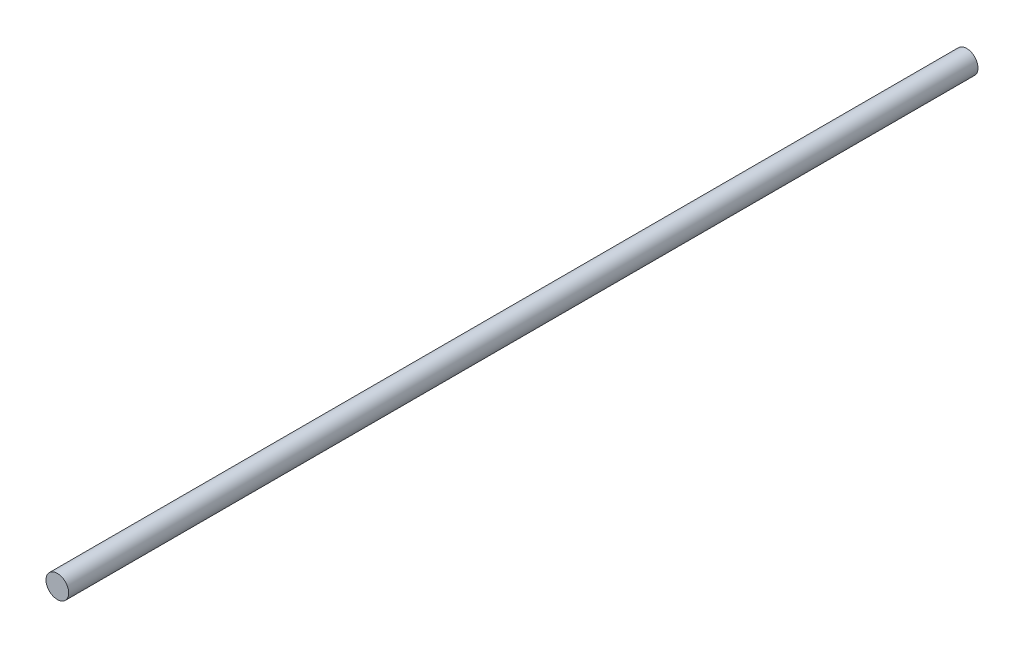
from build123d import *

# Parameters (mm, degrees)
SKETCH1_R           = 30
BOSS_EXTRUDE1_DEPTH = 2400


with BuildPart() as part:
    # Sketch1 → Boss-Extrude1 (new body)
    with BuildSketch(Plane.XY):
        Circle(SKETCH1_R)
    extrude(amount=-BOSS_EXTRUDE1_DEPTH)


solid = part.part
